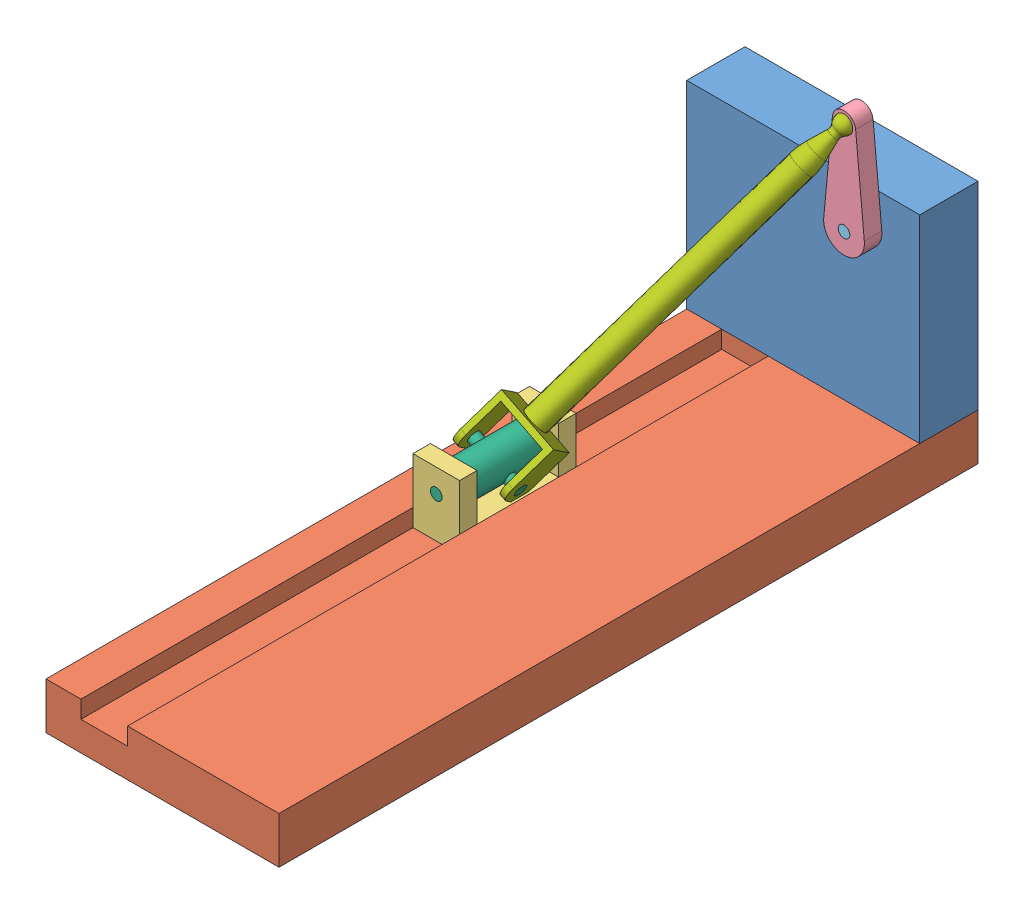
SolidWorks assembly Assem1.SLDASM, configuration Default (file format 7000). Lengths in mm.
Overall size (200 285.12 600).
7 component instances, 7 part files, 14 mates.
Components (placement in the parent):
- Part1--vetical base-1: Part1--vetical base.SLDPRT [Default] at (85.8265 69.5318 75.7467) size (200 170 50)
- Part2--horizen base-1: Part2--horizen base.SLDPRT [Default] at (35.8265 49.5318 675.7467) size (200 40 600)
- part3--sliding block-1: part3--sliding block.SLDPRT [Default] at (65.8265 34.5318 390.7467) size (40 55 100)
- Part4--crank AB-1: Part4--crank AB.SLDPRT [Default] at (185.8265 269.5318 140.7467) x (0 -1 0) z (1 0 0) size (107.5 15 35)
- Part5--pin1-1: Part5--pin1.SLDPRT [Default] at (185.8265 189.5318 75.7467) size (10 10 65)
- Part6--universal joint-1: Part6--universal joint.SLDPRT [Default] at (85.8265 69.5318 290.7467) x (0.894427 -0.447214 0) z (0.447214 0.894427 0) size (50 100 30)
- Part7--connecting rod BC-1: Part7--connecting rod BC.SLDPRT [Default] at (85.8265 69.5318 340.7467) x (0.894427 -0.447214 0) z (0.298142 0.596285 0.745356) size (50 317.5 30)
Mates (geometry in assembly coordinates):
- Coincident1: coincident: plane of Part1--vetical base-1 through (235.8265 69.5318 125.7467) normal (1 0 0); plane of Part2--horizen base-1 through (235.8265 49.5318 75.7467) normal (1 0 0)
- Coincident2: coincident: plane of Part1--vetical base-1 through (85.8265 49.5318 75.7467) normal (0 -1 0); plane of Part2--horizen base-1 through (35.8265 49.5318 75.7467) normal (0 1 0)
- Coincident3: coincident: plane of Part1--vetical base-1 through (85.8265 69.5318 75.7467) normal (0 0 -1); plane of Part2--horizen base-1 through (35.8265 49.5318 75.7467) normal (0 0 -1)
- Concentric1: concentric: cylinder of Part1--vetical base-1 through (185.8265 189.5318 75.7467) axis (0 0 1) radius 5; cylinder of Part5--pin1-1 through (185.8265 189.5318 140.7467) axis (0 0 -1) radius 5
- Coincident4: coincident: plane of Part1--vetical base-1 through (85.8265 69.5318 75.7467) normal (0 0 -1); plane of Part5--pin1-1 through (185.8265 189.5318 75.7467) normal (0 0 -1)
- Concentric2: concentric: cylinder of Part4--crank AB-1 through (185.8265 189.5318 140.7467) axis (0 0 -1) radius 5; cylinder of Part5--pin1-1 through (185.8265 189.5318 140.7467) axis (0 0 -1) radius 5
- Coincident5: coincident: plane of Part4--crank AB-1 through (185.8265 269.5318 140.7467) normal (0 0 1); plane of Part5--pin1-1 through (185.8265 189.5318 140.7467) normal (0 0 1)
- Coincident6: coincident: plane of Part2--horizen base-1 through (105.8265 49.5318 125.7467) normal (-1 0 0); plane of part3--sliding block-1 through (105.8265 34.5318 290.7467) normal (1 0 0)
- Coincident7: coincident: plane of Part2--horizen base-1 through (105.8265 34.5318 125.7467) normal (0 1 0); plane of part3--sliding block-1 through (65.8265 34.5318 290.7467) normal (0 -1 0)
- Concentric3: concentric: cylinder of part3--sliding block-1 through (85.8265 69.5318 290.7467) axis (0 0 1) radius 5; cylinder of Part6--universal joint-1 through (85.8265 69.5318 263.0003) axis (0 0 -1) radius 5
- Coincident8: coincident: plane of part3--sliding block-1 through (65.8265 34.5318 290.7467) normal (0 0 -1); plane of Part6--universal joint-1 through (85.8265 69.5318 290.7467) normal (0 0 -1)
- Concentric4: concentric: cylinder of Part6--universal joint-1 through (63.4658 80.7121 340.7467) axis (0.894427 -0.447214 0) radius 5; cylinder of Part7--connecting rod BC-1 through (108.1872 58.3514 340.7467) axis (-0.894427 0.447214 0) radius 5
- Coincident9: coincident: plane of Part6--universal joint-1; plane of Part7--connecting rod BC-1
- Concentric5: concentric: sphere of Part4--crank AB-1; unknown of Part7--connecting rod BC-1
